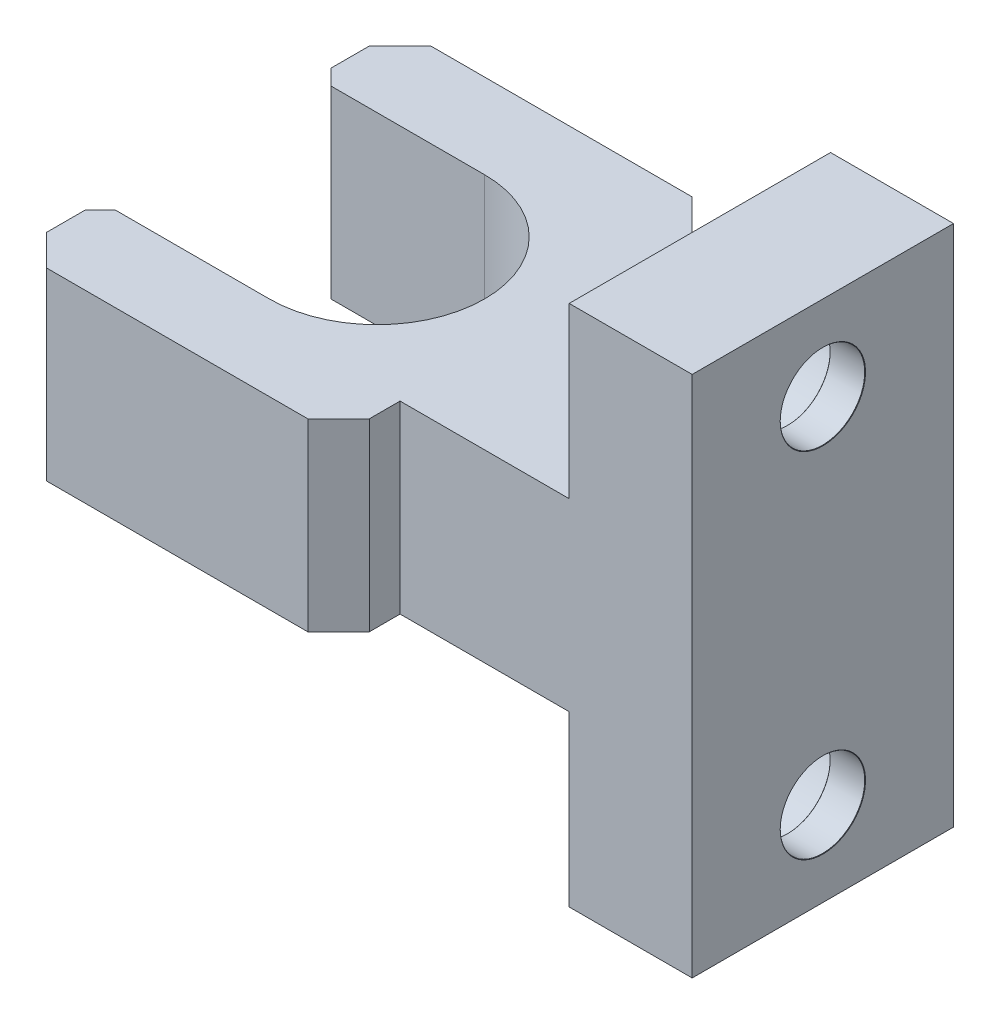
ISO-10303-21;
HEADER;
FILE_DESCRIPTION(('STEP AP214'),'2;1');
FILE_NAME('part.step','',(''),(''),'','','');
FILE_SCHEMA(('AUTOMOTIVE_DESIGN { 1 0 10303 214 1 1 1 1 }'));
ENDSEC;
DATA;
#1=APPLICATION_CONTEXT('core data for automotive mechanical design processes');
#2=APPLICATION_PROTOCOL_DEFINITION('international standard','automotive_design',2000,#1);
#3=PRODUCT_CONTEXT('',#1,'mechanical');
#4=PRODUCT('Part','Part','',(#3));
#5=PRODUCT_RELATED_PRODUCT_CATEGORY('part','',(#4));
#6=PRODUCT_DEFINITION_FORMATION('','',#4);
#7=PRODUCT_DEFINITION_CONTEXT('part definition',#1,'design');
#8=PRODUCT_DEFINITION('design','',#6,#7);
#9=PRODUCT_DEFINITION_SHAPE('','',#8);
#10=(LENGTH_UNIT() NAMED_UNIT(*) SI_UNIT(.MILLI.,.METRE.));
#11=(NAMED_UNIT(*) PLANE_ANGLE_UNIT() SI_UNIT($,.RADIAN.));
#12=(NAMED_UNIT(*) SI_UNIT($,.STERADIAN.) SOLID_ANGLE_UNIT());
#13=UNCERTAINTY_MEASURE_WITH_UNIT(LENGTH_MEASURE(1.E-05),#10,'distance_accuracy_value','');
#14=(GEOMETRIC_REPRESENTATION_CONTEXT(3) GLOBAL_UNCERTAINTY_ASSIGNED_CONTEXT((#13)) GLOBAL_UNIT_ASSIGNED_CONTEXT((#10,
#11,#12)) REPRESENTATION_CONTEXT('',''));
#15=CARTESIAN_POINT('',(0.,0.,0.));
#16=DIRECTION('',(0.,0.,1.));
#17=DIRECTION('',(1.,0.,0.));
#18=AXIS2_PLACEMENT_3D('',#15,#16,#17);
#19=CARTESIAN_POINT('',(-100.,-256.106230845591,17.));
#20=DIRECTION('',(1.,0.,0.));
#21=DIRECTION('',(0.,0.,-1.));
#22=AXIS2_PLACEMENT_3D('',#19,#20,#21);
#23=PLANE('',#22);
#24=DIRECTION('',(0.,0.,-1.));
#25=VECTOR('',#24,1.);
#26=CARTESIAN_POINT('',(-100.,-244.106230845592,17.));
#27=LINE('',#26,#25);
#28=CARTESIAN_POINT('',(-100.,-244.106230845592,19.));
#29=VERTEX_POINT('',#28);
#30=CARTESIAN_POINT('',(-100.,-244.106230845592,16.5));
#31=VERTEX_POINT('',#30);
#32=EDGE_CURVE('E292',#29,#31,#27,.T.);
#33=ORIENTED_EDGE('',*,*,#32,.T.);
#34=DIRECTION('',(0.,-1.,0.));
#35=VECTOR('',#34,1.);
#36=CARTESIAN_POINT('',(-100.,-256.106230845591,16.5));
#37=LINE('',#36,#35);
#38=CARTESIAN_POINT('',(-100.,-256.106230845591,16.5));
#39=VERTEX_POINT('',#38);
#40=EDGE_CURVE('E24',#31,#39,#37,.T.);
#41=ORIENTED_EDGE('',*,*,#40,.T.);
#42=DIRECTION('',(0.,0.,-1.));
#43=VECTOR('',#42,1.);
#44=CARTESIAN_POINT('',(-100.,-256.106230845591,17.));
#45=LINE('',#44,#43);
#46=CARTESIAN_POINT('',(-100.,-256.106230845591,19.));
#47=VERTEX_POINT('',#46);
#48=EDGE_CURVE('E290',#47,#39,#45,.T.);
#49=ORIENTED_EDGE('',*,*,#48,.F.);
#50=DIRECTION('',(0.,1.,0.));
#51=VECTOR('',#50,1.);
#52=CARTESIAN_POINT('',(-100.,-244.106230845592,19.));
#53=LINE('',#52,#51);
#54=EDGE_CURVE('E271',#47,#29,#53,.T.);
#55=ORIENTED_EDGE('',*,*,#54,.T.);
#56=EDGE_LOOP('',(#33,#41,#49,#55));
#57=FACE_BOUND('',#56,.T.);
#58=ADVANCED_FACE('F16',(#57),#23,.F.);
#59=CARTESIAN_POINT('',(0.,0.,17.));
#60=DIRECTION('',(0.,0.,1.));
#61=DIRECTION('',(1.,0.,0.));
#62=AXIS2_PLACEMENT_3D('',#59,#60,#61);
#63=PLANE('',#62);
#64=DIRECTION('',(-1.,0.,0.));
#65=VECTOR('',#64,1.);
#66=CARTESIAN_POINT('',(-68.,-244.106230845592,17.));
#67=LINE('',#66,#65);
#68=CARTESIAN_POINT('',(-68.,-244.106230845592,17.));
#69=VERTEX_POINT('',#68);
#70=CARTESIAN_POINT('',(-79.,-244.106230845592,17.));
#71=VERTEX_POINT('',#70);
#72=EDGE_CURVE('E243',#69,#71,#67,.T.);
#73=ORIENTED_EDGE('',*,*,#72,.T.);
#74=DIRECTION('',(0.,-1.,0.));
#75=VECTOR('',#74,1.);
#76=CARTESIAN_POINT('',(-79.,-244.106230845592,17.));
#77=LINE('',#76,#75);
#78=CARTESIAN_POINT('',(-79.,-256.106230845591,17.));
#79=VERTEX_POINT('',#78);
#80=EDGE_CURVE('E204',#71,#79,#77,.T.);
#81=ORIENTED_EDGE('',*,*,#80,.T.);
#82=DIRECTION('',(1.,0.,0.));
#83=VECTOR('',#82,1.);
#84=CARTESIAN_POINT('',(-68.,-256.106230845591,17.));
#85=LINE('',#84,#83);
#86=CARTESIAN_POINT('',(-68.,-256.106230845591,17.));
#87=VERTEX_POINT('',#86);
#88=EDGE_CURVE('E368',#79,#87,#85,.T.);
#89=ORIENTED_EDGE('',*,*,#88,.T.);
#90=DIRECTION('',(0.,-1.,0.));
#91=VECTOR('',#90,1.);
#92=CARTESIAN_POINT('',(-68.,-267.106230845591,17.));
#93=LINE('',#92,#91);
#94=CARTESIAN_POINT('',(-68.,-267.106230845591,17.));
#95=VERTEX_POINT('',#94);
#96=EDGE_CURVE('E339',#87,#95,#93,.T.);
#97=ORIENTED_EDGE('',*,*,#96,.T.);
#98=DIRECTION('',(1.,0.,0.));
#99=VECTOR('',#98,1.);
#100=CARTESIAN_POINT('',(-60.,-267.106230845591,17.));
#101=LINE('',#100,#99);
#102=CARTESIAN_POINT('',(-60.,-267.106230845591,17.));
#103=VERTEX_POINT('',#102);
#104=EDGE_CURVE('E327',#95,#103,#101,.T.);
#105=ORIENTED_EDGE('',*,*,#104,.T.);
#106=DIRECTION('',(0.,1.,0.));
#107=VECTOR('',#106,1.);
#108=CARTESIAN_POINT('',(-60.,-267.106230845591,17.));
#109=LINE('',#108,#107);
#110=CARTESIAN_POINT('',(-60.,-233.106230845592,17.));
#111=VERTEX_POINT('',#110);
#112=EDGE_CURVE('E323',#103,#111,#109,.T.);
#113=ORIENTED_EDGE('',*,*,#112,.T.);
#114=DIRECTION('',(-1.,0.,0.));
#115=VECTOR('',#114,1.);
#116=CARTESIAN_POINT('',(-60.,-233.106230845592,17.));
#117=LINE('',#116,#115);
#118=CARTESIAN_POINT('',(-68.,-233.106230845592,17.));
#119=VERTEX_POINT('',#118);
#120=EDGE_CURVE('E357',#111,#119,#117,.T.);
#121=ORIENTED_EDGE('',*,*,#120,.T.);
#122=DIRECTION('',(0.,-1.,0.));
#123=VECTOR('',#122,1.);
#124=CARTESIAN_POINT('',(-68.,-244.106230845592,17.));
#125=LINE('',#124,#123);
#126=EDGE_CURVE('E359',#119,#69,#125,.T.);
#127=ORIENTED_EDGE('',*,*,#126,.T.);
#128=EDGE_LOOP('',(#73,#81,#89,#97,#105,#113,#121,#127));
#129=FACE_BOUND('',#128,.T.);
#130=ADVANCED_FACE('F376',(#129),#63,.T.);
#131=CARTESIAN_POINT('',(0.,0.,0.));
#132=DIRECTION('',(0.,0.,1.));
#133=DIRECTION('',(1.,0.,0.));
#134=AXIS2_PLACEMENT_3D('',#131,#132,#133);
#135=PLANE('',#134);
#136=DIRECTION('',(0.,-1.,0.));
#137=VECTOR('',#136,1.);
#138=CARTESIAN_POINT('',(-79.,-244.106230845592,0.));
#139=LINE('',#138,#137);
#140=CARTESIAN_POINT('',(-79.,-244.106230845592,0.));
#141=VERTEX_POINT('',#140);
#142=CARTESIAN_POINT('',(-79.,-256.106230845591,0.));
#143=VERTEX_POINT('',#142);
#144=EDGE_CURVE('E238',#141,#143,#139,.T.);
#145=ORIENTED_EDGE('',*,*,#144,.F.);
#146=DIRECTION('',(-1.,0.,0.));
#147=VECTOR('',#146,1.);
#148=CARTESIAN_POINT('',(-68.,-244.106230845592,0.));
#149=LINE('',#148,#147);
#150=CARTESIAN_POINT('',(-68.,-244.106230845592,0.));
#151=VERTEX_POINT('',#150);
#152=EDGE_CURVE('E314',#151,#141,#149,.T.);
#153=ORIENTED_EDGE('',*,*,#152,.F.);
#154=DIRECTION('',(0.,-1.,0.));
#155=VECTOR('',#154,1.);
#156=CARTESIAN_POINT('',(-68.,-244.106230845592,0.));
#157=LINE('',#156,#155);
#158=CARTESIAN_POINT('',(-68.,-233.106230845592,0.));
#159=VERTEX_POINT('',#158);
#160=EDGE_CURVE('E532',#159,#151,#157,.T.);
#161=ORIENTED_EDGE('',*,*,#160,.F.);
#162=DIRECTION('',(-1.,0.,0.));
#163=VECTOR('',#162,1.);
#164=CARTESIAN_POINT('',(-60.,-233.106230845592,0.));
#165=LINE('',#164,#163);
#166=CARTESIAN_POINT('',(-60.,-233.106230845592,0.));
#167=VERTEX_POINT('',#166);
#168=EDGE_CURVE('E534',#167,#159,#165,.T.);
#169=ORIENTED_EDGE('',*,*,#168,.F.);
#170=DIRECTION('',(0.,1.,0.));
#171=VECTOR('',#170,1.);
#172=CARTESIAN_POINT('',(-60.,-267.106230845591,0.));
#173=LINE('',#172,#171);
#174=CARTESIAN_POINT('',(-60.,-267.106230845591,0.));
#175=VERTEX_POINT('',#174);
#176=EDGE_CURVE('E348',#175,#167,#173,.T.);
#177=ORIENTED_EDGE('',*,*,#176,.F.);
#178=DIRECTION('',(1.,0.,0.));
#179=VECTOR('',#178,1.);
#180=CARTESIAN_POINT('',(-60.,-267.106230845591,0.));
#181=LINE('',#180,#179);
#182=CARTESIAN_POINT('',(-68.,-267.106230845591,0.));
#183=VERTEX_POINT('',#182);
#184=EDGE_CURVE('E321',#183,#175,#181,.T.);
#185=ORIENTED_EDGE('',*,*,#184,.F.);
#186=DIRECTION('',(0.,-1.,0.));
#187=VECTOR('',#186,1.);
#188=CARTESIAN_POINT('',(-68.,-267.106230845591,0.));
#189=LINE('',#188,#187);
#190=CARTESIAN_POINT('',(-68.,-256.106230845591,0.));
#191=VERTEX_POINT('',#190);
#192=EDGE_CURVE('E313',#191,#183,#189,.T.);
#193=ORIENTED_EDGE('',*,*,#192,.F.);
#194=DIRECTION('',(1.,0.,0.));
#195=VECTOR('',#194,1.);
#196=CARTESIAN_POINT('',(-68.,-256.106230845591,0.));
#197=LINE('',#196,#195);
#198=EDGE_CURVE('E311',#143,#191,#197,.T.);
#199=ORIENTED_EDGE('',*,*,#198,.F.);
#200=EDGE_LOOP('',(#145,#153,#161,#169,#177,#185,#193,#199));
#201=FACE_BOUND('',#200,.T.);
#202=ADVANCED_FACE('F344',(#201),#135,.F.);
#203=CARTESIAN_POINT('',(-60.,-267.106230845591,17.));
#204=DIRECTION('',(-1.,0.,0.));
#205=DIRECTION('',(0.,-1.,0.));
#206=AXIS2_PLACEMENT_3D('',#203,#204,#205);
#207=PLANE('',#206);
#208=CARTESIAN_POINT('',(-60.,-261.606230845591,8.5));
#209=DIRECTION('',(-1.,0.,0.));
#210=DIRECTION('',(0.,0.,1.));
#211=AXIS2_PLACEMENT_3D('',#208,#209,#210);
#212=CIRCLE('',#211,2.775);
#213=CARTESIAN_POINT('',(-60.,-261.606230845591,11.275));
#214=VERTEX_POINT('',#213);
#215=EDGE_CURVE('E455',#214,#214,#212,.T.);
#216=ORIENTED_EDGE('',*,*,#215,.T.);
#217=EDGE_LOOP('',(#216));
#218=FACE_BOUND('',#217,.T.);
#219=CARTESIAN_POINT('',(-60.,-238.606230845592,8.5));
#220=DIRECTION('',(-1.,0.,0.));
#221=DIRECTION('',(0.,0.,1.));
#222=AXIS2_PLACEMENT_3D('',#219,#220,#221);
#223=CIRCLE('',#222,2.775);
#224=CARTESIAN_POINT('',(-60.,-238.606230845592,11.275));
#225=VERTEX_POINT('',#224);
#226=EDGE_CURVE('E474',#225,#225,#223,.T.);
#227=ORIENTED_EDGE('',*,*,#226,.T.);
#228=EDGE_LOOP('',(#227));
#229=FACE_BOUND('',#228,.T.);
#230=ORIENTED_EDGE('',*,*,#176,.T.);
#231=DIRECTION('',(0.,0.,-1.));
#232=VECTOR('',#231,1.);
#233=CARTESIAN_POINT('',(-60.,-233.106230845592,17.));
#234=LINE('',#233,#232);
#235=EDGE_CURVE('E227',#111,#167,#234,.T.);
#236=ORIENTED_EDGE('',*,*,#235,.F.);
#237=ORIENTED_EDGE('',*,*,#112,.F.);
#238=DIRECTION('',(0.,0.,-1.));
#239=VECTOR('',#238,1.);
#240=CARTESIAN_POINT('',(-60.,-267.106230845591,17.));
#241=LINE('',#240,#239);
#242=EDGE_CURVE('E324',#103,#175,#241,.T.);
#243=ORIENTED_EDGE('',*,*,#242,.T.);
#244=EDGE_LOOP('',(#230,#236,#237,#243));
#245=FACE_BOUND('',#244,.T.);
#246=ADVANCED_FACE('F353',(#218,#229,#245),#207,.F.);
#247=CARTESIAN_POINT('',(-60.,-233.106230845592,17.));
#248=DIRECTION('',(0.,-1.,0.));
#249=DIRECTION('',(0.,0.,-1.));
#250=AXIS2_PLACEMENT_3D('',#247,#248,#249);
#251=PLANE('',#250);
#252=ORIENTED_EDGE('',*,*,#168,.T.);
#253=DIRECTION('',(0.,0.,-1.));
#254=VECTOR('',#253,1.);
#255=CARTESIAN_POINT('',(-68.,-233.106230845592,17.));
#256=LINE('',#255,#254);
#257=EDGE_CURVE('E306',#119,#159,#256,.T.);
#258=ORIENTED_EDGE('',*,*,#257,.F.);
#259=ORIENTED_EDGE('',*,*,#120,.F.);
#260=ORIENTED_EDGE('',*,*,#235,.T.);
#261=EDGE_LOOP('',(#252,#258,#259,#260));
#262=FACE_BOUND('',#261,.T.);
#263=ADVANCED_FACE('F529',(#262),#251,.F.);
#264=CARTESIAN_POINT('',(-68.,-244.106230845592,17.));
#265=DIRECTION('',(1.,0.,0.));
#266=DIRECTION('',(0.,0.,-1.));
#267=AXIS2_PLACEMENT_3D('',#264,#265,#266);
#268=PLANE('',#267);
#269=CARTESIAN_POINT('',(-68.,-238.606230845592,8.5));
#270=DIRECTION('',(-1.,0.,0.));
#271=DIRECTION('',(0.,0.,1.));
#272=AXIS2_PLACEMENT_3D('',#269,#270,#271);
#273=CIRCLE('',#272,5.025);
#274=CARTESIAN_POINT('',(-68.,-238.606230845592,13.525));
#275=VERTEX_POINT('',#274);
#276=EDGE_CURVE('E477',#275,#275,#273,.T.);
#277=ORIENTED_EDGE('',*,*,#276,.F.);
#278=EDGE_LOOP('',(#277));
#279=FACE_BOUND('',#278,.T.);
#280=ORIENTED_EDGE('',*,*,#160,.T.);
#281=DIRECTION('',(0.,0.,-1.));
#282=VECTOR('',#281,1.);
#283=CARTESIAN_POINT('',(-68.,-244.106230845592,17.));
#284=LINE('',#283,#282);
#285=EDGE_CURVE('E303',#69,#151,#284,.T.);
#286=ORIENTED_EDGE('',*,*,#285,.F.);
#287=ORIENTED_EDGE('',*,*,#126,.F.);
#288=ORIENTED_EDGE('',*,*,#257,.T.);
#289=EDGE_LOOP('',(#280,#286,#287,#288));
#290=FACE_BOUND('',#289,.T.);
#291=ADVANCED_FACE('F427',(#279,#290),#268,.F.);
#292=CARTESIAN_POINT('',(-68.,-244.106230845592,17.));
#293=DIRECTION('',(0.,-1.,0.));
#294=DIRECTION('',(0.,0.,-1.));
#295=AXIS2_PLACEMENT_3D('',#292,#293,#294);
#296=PLANE('',#295);
#297=CARTESIAN_POINT('',(-100.,-244.106230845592,0.5));
#298=VERTEX_POINT('',#297);
#299=CARTESIAN_POINT('',(-100.,-244.106230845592,-2.));
#300=VERTEX_POINT('',#299);
#301=EDGE_CURVE('E295',#298,#300,#27,.T.);
#302=ORIENTED_EDGE('',*,*,#301,.F.);
#303=DIRECTION('',(-0.707106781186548,0.,-0.707106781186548));
#304=VECTOR('',#303,1.);
#305=CARTESIAN_POINT('',(-99.,-244.106230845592,1.5));
#306=LINE('',#305,#304);
#307=CARTESIAN_POINT('',(-99.,-244.106230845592,1.5));
#308=VERTEX_POINT('',#307);
#309=EDGE_CURVE('E284',#298,#308,#306,.F.);
#310=ORIENTED_EDGE('',*,*,#309,.T.);
#311=DIRECTION('',(1.,0.,0.));
#312=VECTOR('',#311,1.);
#313=CARTESIAN_POINT('',(-68.,-244.106230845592,1.5));
#314=LINE('',#313,#312);
#315=CARTESIAN_POINT('',(-89.,-244.106230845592,1.5));
#316=VERTEX_POINT('',#315);
#317=EDGE_CURVE('E194',#308,#316,#314,.T.);
#318=ORIENTED_EDGE('',*,*,#317,.T.);
#319=CARTESIAN_POINT('',(-89.,-244.106230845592,8.5));
#320=DIRECTION('',(0.,-1.,0.));
#321=DIRECTION('',(0.,0.,-1.));
#322=AXIS2_PLACEMENT_3D('',#319,#320,#321);
#323=CIRCLE('',#322,7.);
#324=CARTESIAN_POINT('',(-89.,-244.106230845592,15.5));
#325=VERTEX_POINT('',#324);
#326=EDGE_CURVE('E185',#316,#325,#323,.T.);
#327=ORIENTED_EDGE('',*,*,#326,.T.);
#328=DIRECTION('',(-1.,0.,0.));
#329=VECTOR('',#328,1.);
#330=CARTESIAN_POINT('',(-68.,-244.106230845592,15.5));
#331=LINE('',#330,#329);
#332=CARTESIAN_POINT('',(-99.,-244.106230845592,15.5));
#333=VERTEX_POINT('',#332);
#334=EDGE_CURVE('E198',#325,#333,#331,.T.);
#335=ORIENTED_EDGE('',*,*,#334,.T.);
#336=DIRECTION('',(0.707106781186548,0.,-0.707106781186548));
#337=VECTOR('',#336,1.);
#338=CARTESIAN_POINT('',(-100.,-244.106230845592,16.5));
#339=LINE('',#338,#337);
#340=EDGE_CURVE('E31',#333,#31,#339,.F.);
#341=ORIENTED_EDGE('',*,*,#340,.T.);
#342=ORIENTED_EDGE('',*,*,#32,.F.);
#343=DIRECTION('',(0.707106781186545,0.,0.70710678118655));
#344=VECTOR('',#343,1.);
#345=CARTESIAN_POINT('',(-98.,-244.106230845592,21.));
#346=LINE('',#345,#344);
#347=CARTESIAN_POINT('',(-98.,-244.106230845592,21.));
#348=VERTEX_POINT('',#347);
#349=EDGE_CURVE('E256',#29,#348,#346,.T.);
#350=ORIENTED_EDGE('',*,*,#349,.T.);
#351=DIRECTION('',(-1.,0.,0.));
#352=VECTOR('',#351,1.);
#353=CARTESIAN_POINT('',(-100.,-244.106230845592,21.));
#354=LINE('',#353,#352);
#355=CARTESIAN_POINT('',(-81.,-244.106230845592,21.));
#356=VERTEX_POINT('',#355);
#357=EDGE_CURVE('E201',#356,#348,#354,.T.);
#358=ORIENTED_EDGE('',*,*,#357,.F.);
#359=DIRECTION('',(-0.70710678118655,0.,0.707106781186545));
#360=VECTOR('',#359,1.);
#361=CARTESIAN_POINT('',(-79.,-244.106230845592,19.));
#362=LINE('',#361,#360);
#363=CARTESIAN_POINT('',(-79.,-244.106230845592,19.));
#364=VERTEX_POINT('',#363);
#365=EDGE_CURVE('E254',#356,#364,#362,.F.);
#366=ORIENTED_EDGE('',*,*,#365,.T.);
#367=DIRECTION('',(0.,0.,1.));
#368=VECTOR('',#367,1.);
#369=CARTESIAN_POINT('',(-79.,-244.106230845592,17.));
#370=LINE('',#369,#368);
#371=EDGE_CURVE('E205',#71,#364,#370,.T.);
#372=ORIENTED_EDGE('',*,*,#371,.F.);
#373=ORIENTED_EDGE('',*,*,#72,.F.);
#374=ORIENTED_EDGE('',*,*,#285,.T.);
#375=ORIENTED_EDGE('',*,*,#152,.T.);
#376=DIRECTION('',(0.,0.,1.));
#377=VECTOR('',#376,1.);
#378=CARTESIAN_POINT('',(-79.,-244.106230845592,0.));
#379=LINE('',#378,#377);
#380=CARTESIAN_POINT('',(-79.,-244.106230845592,-2.));
#381=VERTEX_POINT('',#380);
#382=EDGE_CURVE('E247',#381,#141,#379,.T.);
#383=ORIENTED_EDGE('',*,*,#382,.F.);
#384=DIRECTION('',(0.707106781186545,0.,0.70710678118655));
#385=VECTOR('',#384,1.);
#386=CARTESIAN_POINT('',(-81.,-244.106230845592,-4.));
#387=LINE('',#386,#385);
#388=CARTESIAN_POINT('',(-81.,-244.106230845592,-4.));
#389=VERTEX_POINT('',#388);
#390=EDGE_CURVE('E261',#381,#389,#387,.F.);
#391=ORIENTED_EDGE('',*,*,#390,.T.);
#392=DIRECTION('',(1.,0.,0.));
#393=VECTOR('',#392,1.);
#394=CARTESIAN_POINT('',(-100.,-244.106230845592,-4.));
#395=LINE('',#394,#393);
#396=CARTESIAN_POINT('',(-98.,-244.106230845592,-4.));
#397=VERTEX_POINT('',#396);
#398=EDGE_CURVE('E211',#397,#389,#395,.T.);
#399=ORIENTED_EDGE('',*,*,#398,.F.);
#400=DIRECTION('',(-0.70710678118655,0.,0.707106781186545));
#401=VECTOR('',#400,1.);
#402=CARTESIAN_POINT('',(-100.,-244.106230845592,-2.));
#403=LINE('',#402,#401);
#404=EDGE_CURVE('E258',#397,#300,#403,.T.);
#405=ORIENTED_EDGE('',*,*,#404,.T.);
#406=EDGE_LOOP('',(#302,#310,#318,#327,#335,#341,#342,#350,#358,#366,#372,#373,#374,#375,#383,
#391,#399,#405));
#407=FACE_BOUND('',#406,.T.);
#408=ADVANCED_FACE('F381',(#407),#296,.F.);
#409=CARTESIAN_POINT('',(-100.,-256.106230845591,0.5));
#410=VERTEX_POINT('',#409);
#411=CARTESIAN_POINT('',(-100.,-256.106230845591,-2.));
#412=VERTEX_POINT('',#411);
#413=EDGE_CURVE('E296',#410,#412,#45,.T.);
#414=ORIENTED_EDGE('',*,*,#413,.F.);
#415=DIRECTION('',(0.,1.,0.));
#416=VECTOR('',#415,1.);
#417=CARTESIAN_POINT('',(-100.,-256.106230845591,0.5));
#418=LINE('',#417,#416);
#419=EDGE_CURVE('E281',#410,#298,#418,.T.);
#420=ORIENTED_EDGE('',*,*,#419,.T.);
#421=ORIENTED_EDGE('',*,*,#301,.T.);
#422=DIRECTION('',(0.,-1.,0.));
#423=VECTOR('',#422,1.);
#424=CARTESIAN_POINT('',(-100.,-256.106230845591,-2.));
#425=LINE('',#424,#423);
#426=EDGE_CURVE('E263',#300,#412,#425,.T.);
#427=ORIENTED_EDGE('',*,*,#426,.T.);
#428=EDGE_LOOP('',(#414,#420,#421,#427));
#429=FACE_BOUND('',#428,.T.);
#430=ADVANCED_FACE('F417',(#429),#23,.F.);
#431=CARTESIAN_POINT('',(-68.,-256.106230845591,17.));
#432=DIRECTION('',(0.,1.,0.));
#433=DIRECTION('',(0.,0.,1.));
#434=AXIS2_PLACEMENT_3D('',#431,#432,#433);
#435=PLANE('',#434);
#436=DIRECTION('',(1.,0.,0.));
#437=VECTOR('',#436,1.);
#438=CARTESIAN_POINT('',(-100.,-256.106230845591,1.5));
#439=LINE('',#438,#437);
#440=CARTESIAN_POINT('',(-99.,-256.106230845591,1.5));
#441=VERTEX_POINT('',#440);
#442=CARTESIAN_POINT('',(-89.,-256.106230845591,1.5));
#443=VERTEX_POINT('',#442);
#444=EDGE_CURVE('E166',#441,#443,#439,.T.);
#445=ORIENTED_EDGE('',*,*,#444,.F.);
#446=DIRECTION('',(0.707106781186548,0.,0.707106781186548));
#447=VECTOR('',#446,1.);
#448=CARTESIAN_POINT('',(-99.,-256.106230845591,1.5));
#449=LINE('',#448,#447);
#450=EDGE_CURVE('E279',#441,#410,#449,.F.);
#451=ORIENTED_EDGE('',*,*,#450,.T.);
#452=ORIENTED_EDGE('',*,*,#413,.T.);
#453=DIRECTION('',(0.70710678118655,0.,-0.707106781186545));
#454=VECTOR('',#453,1.);
#455=CARTESIAN_POINT('',(-100.,-256.106230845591,-2.));
#456=LINE('',#455,#454);
#457=CARTESIAN_POINT('',(-98.,-256.106230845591,-4.));
#458=VERTEX_POINT('',#457);
#459=EDGE_CURVE('E389',#412,#458,#456,.T.);
#460=ORIENTED_EDGE('',*,*,#459,.T.);
#461=DIRECTION('',(1.,0.,0.));
#462=VECTOR('',#461,1.);
#463=CARTESIAN_POINT('',(-100.,-256.106230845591,-4.));
#464=LINE('',#463,#462);
#465=CARTESIAN_POINT('',(-81.,-256.106230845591,-4.));
#466=VERTEX_POINT('',#465);
#467=EDGE_CURVE('E217',#458,#466,#464,.T.);
#468=ORIENTED_EDGE('',*,*,#467,.T.);
#469=DIRECTION('',(-0.707106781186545,0.,-0.70710678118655));
#470=VECTOR('',#469,1.);
#471=CARTESIAN_POINT('',(-81.,-256.106230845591,-4.));
#472=LINE('',#471,#470);
#473=CARTESIAN_POINT('',(-79.,-256.106230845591,-2.));
#474=VERTEX_POINT('',#473);
#475=EDGE_CURVE('E250',#466,#474,#472,.F.);
#476=ORIENTED_EDGE('',*,*,#475,.T.);
#477=DIRECTION('',(0.,0.,1.));
#478=VECTOR('',#477,1.);
#479=CARTESIAN_POINT('',(-79.,-256.106230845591,0.));
#480=LINE('',#479,#478);
#481=EDGE_CURVE('E231',#474,#143,#480,.T.);
#482=ORIENTED_EDGE('',*,*,#481,.T.);
#483=ORIENTED_EDGE('',*,*,#198,.T.);
#484=DIRECTION('',(0.,0.,-1.));
#485=VECTOR('',#484,1.);
#486=CARTESIAN_POINT('',(-68.,-256.106230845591,17.));
#487=LINE('',#486,#485);
#488=EDGE_CURVE('E299',#87,#191,#487,.T.);
#489=ORIENTED_EDGE('',*,*,#488,.F.);
#490=ORIENTED_EDGE('',*,*,#88,.F.);
#491=DIRECTION('',(0.,0.,1.));
#492=VECTOR('',#491,1.);
#493=CARTESIAN_POINT('',(-79.,-256.106230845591,17.));
#494=LINE('',#493,#492);
#495=CARTESIAN_POINT('',(-79.,-256.106230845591,19.));
#496=VERTEX_POINT('',#495);
#497=EDGE_CURVE('E200',#79,#496,#494,.T.);
#498=ORIENTED_EDGE('',*,*,#497,.T.);
#499=DIRECTION('',(0.70710678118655,0.,-0.707106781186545));
#500=VECTOR('',#499,1.);
#501=CARTESIAN_POINT('',(-79.,-256.106230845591,19.));
#502=LINE('',#501,#500);
#503=CARTESIAN_POINT('',(-81.,-256.106230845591,21.));
#504=VERTEX_POINT('',#503);
#505=EDGE_CURVE('E230',#496,#504,#502,.F.);
#506=ORIENTED_EDGE('',*,*,#505,.T.);
#507=DIRECTION('',(-1.,0.,0.));
#508=VECTOR('',#507,1.);
#509=CARTESIAN_POINT('',(-100.,-256.106230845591,21.));
#510=LINE('',#509,#508);
#511=CARTESIAN_POINT('',(-98.,-256.106230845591,21.));
#512=VERTEX_POINT('',#511);
#513=EDGE_CURVE('E206',#504,#512,#510,.T.);
#514=ORIENTED_EDGE('',*,*,#513,.T.);
#515=DIRECTION('',(-0.707106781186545,0.,-0.70710678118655));
#516=VECTOR('',#515,1.);
#517=CARTESIAN_POINT('',(-98.,-256.106230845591,21.));
#518=LINE('',#517,#516);
#519=EDGE_CURVE('E294',#512,#47,#518,.T.);
#520=ORIENTED_EDGE('',*,*,#519,.T.);
#521=ORIENTED_EDGE('',*,*,#48,.T.);
#522=DIRECTION('',(-0.707106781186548,0.,0.707106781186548));
#523=VECTOR('',#522,1.);
#524=CARTESIAN_POINT('',(-100.,-256.106230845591,16.5));
#525=LINE('',#524,#523);
#526=CARTESIAN_POINT('',(-99.,-256.106230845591,15.5));
#527=VERTEX_POINT('',#526);
#528=EDGE_CURVE('E277',#39,#527,#525,.F.);
#529=ORIENTED_EDGE('',*,*,#528,.T.);
#530=DIRECTION('',(-1.,0.,0.));
#531=VECTOR('',#530,1.);
#532=CARTESIAN_POINT('',(-100.,-256.106230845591,15.5));
#533=LINE('',#532,#531);
#534=CARTESIAN_POINT('',(-89.,-256.106230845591,15.5));
#535=VERTEX_POINT('',#534);
#536=EDGE_CURVE('E187',#535,#527,#533,.T.);
#537=ORIENTED_EDGE('',*,*,#536,.F.);
#538=CARTESIAN_POINT('',(-89.,-256.106230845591,8.5));
#539=DIRECTION('',(0.,-1.,0.));
#540=DIRECTION('',(0.,0.,-1.));
#541=AXIS2_PLACEMENT_3D('',#538,#539,#540);
#542=CIRCLE('',#541,7.);
#543=EDGE_CURVE('E175',#443,#535,#542,.T.);
#544=ORIENTED_EDGE('',*,*,#543,.F.);
#545=EDGE_LOOP('',(#445,#451,#452,#460,#468,#476,#482,#483,#489,#490,#498,#506,#514,#520,#521,
#529,#537,#544));
#546=FACE_BOUND('',#545,.T.);
#547=ADVANCED_FACE('F189',(#546),#435,.F.);
#548=CARTESIAN_POINT('',(-68.,-267.106230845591,17.));
#549=DIRECTION('',(1.,0.,0.));
#550=DIRECTION('',(0.,0.,-1.));
#551=AXIS2_PLACEMENT_3D('',#548,#549,#550);
#552=PLANE('',#551);
#553=CARTESIAN_POINT('',(-68.,-261.606230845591,8.5));
#554=DIRECTION('',(-1.,0.,0.));
#555=DIRECTION('',(0.,0.,1.));
#556=AXIS2_PLACEMENT_3D('',#553,#554,#555);
#557=CIRCLE('',#556,5.025);
#558=CARTESIAN_POINT('',(-68.,-261.606230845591,13.525));
#559=VERTEX_POINT('',#558);
#560=EDGE_CURVE('E452',#559,#559,#557,.T.);
#561=ORIENTED_EDGE('',*,*,#560,.F.);
#562=EDGE_LOOP('',(#561));
#563=FACE_BOUND('',#562,.T.);
#564=ORIENTED_EDGE('',*,*,#192,.T.);
#565=DIRECTION('',(0.,0.,-1.));
#566=VECTOR('',#565,1.);
#567=CARTESIAN_POINT('',(-68.,-267.106230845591,17.));
#568=LINE('',#567,#566);
#569=EDGE_CURVE('E326',#95,#183,#568,.T.);
#570=ORIENTED_EDGE('',*,*,#569,.F.);
#571=ORIENTED_EDGE('',*,*,#96,.F.);
#572=ORIENTED_EDGE('',*,*,#488,.T.);
#573=EDGE_LOOP('',(#564,#570,#571,#572));
#574=FACE_BOUND('',#573,.T.);
#575=ADVANCED_FACE('F338',(#563,#574),#552,.F.);
#576=CARTESIAN_POINT('',(-60.,-267.106230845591,17.));
#577=DIRECTION('',(0.,1.,0.));
#578=DIRECTION('',(0.,0.,1.));
#579=AXIS2_PLACEMENT_3D('',#576,#577,#578);
#580=PLANE('',#579);
#581=ORIENTED_EDGE('',*,*,#184,.T.);
#582=ORIENTED_EDGE('',*,*,#242,.F.);
#583=ORIENTED_EDGE('',*,*,#104,.F.);
#584=ORIENTED_EDGE('',*,*,#569,.T.);
#585=EDGE_LOOP('',(#581,#582,#583,#584));
#586=FACE_BOUND('',#585,.T.);
#587=ADVANCED_FACE('F350',(#586),#580,.F.);
#588=CARTESIAN_POINT('',(-79.,-244.106230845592,0.));
#589=DIRECTION('',(1.,0.,0.));
#590=DIRECTION('',(0.,0.,-1.));
#591=AXIS2_PLACEMENT_3D('',#588,#589,#590);
#592=PLANE('',#591);
#593=ORIENTED_EDGE('',*,*,#481,.F.);
#594=DIRECTION('',(0.,1.,0.));
#595=VECTOR('',#594,1.);
#596=CARTESIAN_POINT('',(-79.,-244.106230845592,-2.));
#597=LINE('',#596,#595);
#598=EDGE_CURVE('E252',#474,#381,#597,.T.);
#599=ORIENTED_EDGE('',*,*,#598,.T.);
#600=ORIENTED_EDGE('',*,*,#382,.T.);
#601=ORIENTED_EDGE('',*,*,#144,.T.);
#602=EDGE_LOOP('',(#593,#599,#600,#601));
#603=FACE_BOUND('',#602,.T.);
#604=ADVANCED_FACE('F398',(#603),#592,.T.);
#605=CARTESIAN_POINT('',(-100.,-244.106230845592,-4.));
#606=DIRECTION('',(0.,0.,-1.));
#607=DIRECTION('',(-1.,0.,0.));
#608=AXIS2_PLACEMENT_3D('',#605,#606,#607);
#609=PLANE('',#608);
#610=ORIENTED_EDGE('',*,*,#398,.T.);
#611=DIRECTION('',(0.,-1.,0.));
#612=VECTOR('',#611,1.);
#613=CARTESIAN_POINT('',(-81.,-244.106230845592,-4.));
#614=LINE('',#613,#612);
#615=EDGE_CURVE('E226',#389,#466,#614,.T.);
#616=ORIENTED_EDGE('',*,*,#615,.T.);
#617=ORIENTED_EDGE('',*,*,#467,.F.);
#618=DIRECTION('',(0.,1.,0.));
#619=VECTOR('',#618,1.);
#620=CARTESIAN_POINT('',(-98.,-244.106230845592,-4.));
#621=LINE('',#620,#619);
#622=EDGE_CURVE('E224',#458,#397,#621,.T.);
#623=ORIENTED_EDGE('',*,*,#622,.T.);
#624=EDGE_LOOP('',(#610,#616,#617,#623));
#625=FACE_BOUND('',#624,.T.);
#626=ADVANCED_FACE('F406',(#625),#609,.T.);
#627=CARTESIAN_POINT('',(-100.,-244.106230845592,21.));
#628=DIRECTION('',(0.,0.,1.));
#629=DIRECTION('',(1.,0.,0.));
#630=AXIS2_PLACEMENT_3D('',#627,#628,#629);
#631=PLANE('',#630);
#632=ORIENTED_EDGE('',*,*,#357,.T.);
#633=DIRECTION('',(0.,-1.,0.));
#634=VECTOR('',#633,1.);
#635=CARTESIAN_POINT('',(-98.,-256.106230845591,21.));
#636=LINE('',#635,#634);
#637=EDGE_CURVE('E268',#348,#512,#636,.T.);
#638=ORIENTED_EDGE('',*,*,#637,.T.);
#639=ORIENTED_EDGE('',*,*,#513,.F.);
#640=DIRECTION('',(0.,1.,0.));
#641=VECTOR('',#640,1.);
#642=CARTESIAN_POINT('',(-81.,-244.106230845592,21.));
#643=LINE('',#642,#641);
#644=EDGE_CURVE('E266',#504,#356,#643,.T.);
#645=ORIENTED_EDGE('',*,*,#644,.T.);
#646=EDGE_LOOP('',(#632,#638,#639,#645));
#647=FACE_BOUND('',#646,.T.);
#648=ADVANCED_FACE('F579',(#647),#631,.T.);
#649=CARTESIAN_POINT('',(-79.,-244.106230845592,17.));
#650=DIRECTION('',(1.,0.,0.));
#651=DIRECTION('',(0.,0.,-1.));
#652=AXIS2_PLACEMENT_3D('',#649,#650,#651);
#653=PLANE('',#652);
#654=ORIENTED_EDGE('',*,*,#371,.T.);
#655=DIRECTION('',(0.,-1.,0.));
#656=VECTOR('',#655,1.);
#657=CARTESIAN_POINT('',(-79.,-244.106230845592,19.));
#658=LINE('',#657,#656);
#659=EDGE_CURVE('E273',#364,#496,#658,.T.);
#660=ORIENTED_EDGE('',*,*,#659,.T.);
#661=ORIENTED_EDGE('',*,*,#497,.F.);
#662=ORIENTED_EDGE('',*,*,#80,.F.);
#663=EDGE_LOOP('',(#654,#660,#661,#662));
#664=FACE_BOUND('',#663,.T.);
#665=ADVANCED_FACE('F372',(#664),#653,.T.);
#666=CARTESIAN_POINT('',(-100.,-233.106230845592,15.5));
#667=DIRECTION('',(0.,0.,1.));
#668=DIRECTION('',(1.,0.,0.));
#669=AXIS2_PLACEMENT_3D('',#666,#667,#668);
#670=PLANE('',#669);
#671=ORIENTED_EDGE('',*,*,#536,.T.);
#672=DIRECTION('',(0.,1.,0.));
#673=VECTOR('',#672,1.);
#674=CARTESIAN_POINT('',(-99.,-233.106230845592,15.5));
#675=LINE('',#674,#673);
#676=EDGE_CURVE('E11',#527,#333,#675,.T.);
#677=ORIENTED_EDGE('',*,*,#676,.T.);
#678=ORIENTED_EDGE('',*,*,#334,.F.);
#679=DIRECTION('',(0.,-1.,0.));
#680=VECTOR('',#679,1.);
#681=CARTESIAN_POINT('',(-89.,-233.106230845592,15.5));
#682=LINE('',#681,#680);
#683=EDGE_CURVE('E186',#325,#535,#682,.T.);
#684=ORIENTED_EDGE('',*,*,#683,.T.);
#685=EDGE_LOOP('',(#671,#677,#678,#684));
#686=FACE_BOUND('',#685,.T.);
#687=ADVANCED_FACE('F572',(#686),#670,.F.);
#688=CARTESIAN_POINT('',(-89.,-233.106230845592,8.5));
#689=DIRECTION('',(0.,-1.,0.));
#690=DIRECTION('',(0.,0.,-1.));
#691=AXIS2_PLACEMENT_3D('',#688,#689,#690);
#692=CYLINDRICAL_SURFACE('',#691,7.);
#693=DIRECTION('',(0.,-1.,0.));
#694=VECTOR('',#693,1.);
#695=CARTESIAN_POINT('',(-89.,-233.106230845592,1.5));
#696=LINE('',#695,#694);
#697=EDGE_CURVE('E170',#316,#443,#696,.T.);
#698=ORIENTED_EDGE('',*,*,#697,.T.);
#699=ORIENTED_EDGE('',*,*,#543,.T.);
#700=ORIENTED_EDGE('',*,*,#683,.F.);
#701=ORIENTED_EDGE('',*,*,#326,.F.);
#702=EDGE_LOOP('',(#698,#699,#700,#701));
#703=FACE_BOUND('',#702,.T.);
#704=ADVANCED_FACE('F181',(#703),#692,.F.);
#705=CARTESIAN_POINT('',(-100.,-233.106230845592,1.5));
#706=DIRECTION('',(0.,0.,-1.));
#707=DIRECTION('',(-1.,0.,0.));
#708=AXIS2_PLACEMENT_3D('',#705,#706,#707);
#709=PLANE('',#708);
#710=ORIENTED_EDGE('',*,*,#317,.F.);
#711=DIRECTION('',(0.,-1.,0.));
#712=VECTOR('',#711,1.);
#713=CARTESIAN_POINT('',(-99.,-233.106230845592,1.5));
#714=LINE('',#713,#712);
#715=EDGE_CURVE('E172',#308,#441,#714,.T.);
#716=ORIENTED_EDGE('',*,*,#715,.T.);
#717=ORIENTED_EDGE('',*,*,#444,.T.);
#718=ORIENTED_EDGE('',*,*,#697,.F.);
#719=EDGE_LOOP('',(#710,#716,#717,#718));
#720=FACE_BOUND('',#719,.T.);
#721=ADVANCED_FACE('F169',(#720),#709,.F.);
#722=CARTESIAN_POINT('',(-81.,-244.106230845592,-4.));
#723=DIRECTION('',(-0.70710678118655,0.,0.707106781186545));
#724=DIRECTION('',(0.,-1.,0.));
#725=AXIS2_PLACEMENT_3D('',#722,#723,#724);
#726=PLANE('',#725);
#727=ORIENTED_EDGE('',*,*,#390,.F.);
#728=ORIENTED_EDGE('',*,*,#598,.F.);
#729=ORIENTED_EDGE('',*,*,#475,.F.);
#730=ORIENTED_EDGE('',*,*,#615,.F.);
#731=EDGE_LOOP('',(#727,#728,#729,#730));
#732=FACE_BOUND('',#731,.T.);
#733=ADVANCED_FACE('F401',(#732),#726,.F.);
#734=CARTESIAN_POINT('',(-100.,-256.106230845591,-2.));
#735=DIRECTION('',(-0.707106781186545,0.,-0.70710678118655));
#736=DIRECTION('',(0.,1.,0.));
#737=AXIS2_PLACEMENT_3D('',#734,#735,#736);
#738=PLANE('',#737);
#739=ORIENTED_EDGE('',*,*,#404,.F.);
#740=ORIENTED_EDGE('',*,*,#622,.F.);
#741=ORIENTED_EDGE('',*,*,#459,.F.);
#742=ORIENTED_EDGE('',*,*,#426,.F.);
#743=EDGE_LOOP('',(#739,#740,#741,#742));
#744=FACE_BOUND('',#743,.T.);
#745=ADVANCED_FACE('F409',(#744),#738,.T.);
#746=CARTESIAN_POINT('',(-98.,-244.106230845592,21.));
#747=DIRECTION('',(-0.70710678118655,0.,0.707106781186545));
#748=DIRECTION('',(0.,1.,0.));
#749=AXIS2_PLACEMENT_3D('',#746,#747,#748);
#750=PLANE('',#749);
#751=ORIENTED_EDGE('',*,*,#349,.F.);
#752=ORIENTED_EDGE('',*,*,#54,.F.);
#753=ORIENTED_EDGE('',*,*,#519,.F.);
#754=ORIENTED_EDGE('',*,*,#637,.F.);
#755=EDGE_LOOP('',(#751,#752,#753,#754));
#756=FACE_BOUND('',#755,.T.);
#757=ADVANCED_FACE('F551',(#756),#750,.T.);
#758=CARTESIAN_POINT('',(-79.,-244.106230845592,19.));
#759=DIRECTION('',(-0.707106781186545,0.,-0.70710678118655));
#760=DIRECTION('',(0.,-1.,0.));
#761=AXIS2_PLACEMENT_3D('',#758,#759,#760);
#762=PLANE('',#761);
#763=ORIENTED_EDGE('',*,*,#365,.F.);
#764=ORIENTED_EDGE('',*,*,#644,.F.);
#765=ORIENTED_EDGE('',*,*,#505,.F.);
#766=ORIENTED_EDGE('',*,*,#659,.F.);
#767=EDGE_LOOP('',(#763,#764,#765,#766));
#768=FACE_BOUND('',#767,.T.);
#769=ADVANCED_FACE('F387',(#768),#762,.F.);
#770=CARTESIAN_POINT('',(-99.,-233.106230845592,1.5));
#771=DIRECTION('',(0.707106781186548,0.,-0.707106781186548));
#772=DIRECTION('',(0.,-1.,0.));
#773=AXIS2_PLACEMENT_3D('',#770,#771,#772);
#774=PLANE('',#773);
#775=ORIENTED_EDGE('',*,*,#309,.F.);
#776=ORIENTED_EDGE('',*,*,#419,.F.);
#777=ORIENTED_EDGE('',*,*,#450,.F.);
#778=ORIENTED_EDGE('',*,*,#715,.F.);
#779=EDGE_LOOP('',(#775,#776,#777,#778));
#780=FACE_BOUND('',#779,.T.);
#781=ADVANCED_FACE('F415',(#780),#774,.F.);
#782=CARTESIAN_POINT('',(-100.,-256.106230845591,16.5));
#783=DIRECTION('',(0.707106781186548,0.,0.707106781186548));
#784=DIRECTION('',(0.,-1.,0.));
#785=AXIS2_PLACEMENT_3D('',#782,#783,#784);
#786=PLANE('',#785);
#787=ORIENTED_EDGE('',*,*,#340,.F.);
#788=ORIENTED_EDGE('',*,*,#676,.F.);
#789=ORIENTED_EDGE('',*,*,#528,.F.);
#790=ORIENTED_EDGE('',*,*,#40,.F.);
#791=EDGE_LOOP('',(#787,#788,#789,#790));
#792=FACE_BOUND('',#791,.T.);
#793=ADVANCED_FACE('F18',(#792),#786,.F.);
#794=CARTESIAN_POINT('',(-60.025,-238.606230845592,8.5));
#795=DIRECTION('',(1.,0.,0.));
#796=DIRECTION('',(0.,0.,-1.));
#797=AXIS2_PLACEMENT_3D('',#794,#795,#796);
#798=CONICAL_SURFACE('',#797,2.75,0.785398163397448);
#799=ORIENTED_EDGE('',*,*,#226,.F.);
#800=EDGE_LOOP('',(#799));
#801=FACE_BOUND('',#800,.T.);
#802=CARTESIAN_POINT('',(-60.025,-238.606230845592,8.5));
#803=DIRECTION('',(-1.,0.,0.));
#804=DIRECTION('',(0.,0.,1.));
#805=AXIS2_PLACEMENT_3D('',#802,#803,#804);
#806=CIRCLE('',#805,2.75);
#807=CARTESIAN_POINT('',(-60.025,-238.606230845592,11.25));
#808=VERTEX_POINT('',#807);
#809=EDGE_CURVE('E176',#808,#808,#806,.T.);
#810=ORIENTED_EDGE('',*,*,#809,.T.);
#811=EDGE_LOOP('',(#810));
#812=FACE_BOUND('',#811,.T.);
#813=ADVANCED_FACE('F494',(#801,#812),#798,.F.);
#814=CARTESIAN_POINT('',(-68.,-238.606230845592,8.5));
#815=DIRECTION('',(-1.,0.,0.));
#816=DIRECTION('',(0.,0.,1.));
#817=AXIS2_PLACEMENT_3D('',#814,#815,#816);
#818=CYLINDRICAL_SURFACE('',#817,2.75);
#819=ORIENTED_EDGE('',*,*,#809,.F.);
#820=EDGE_LOOP('',(#819));
#821=FACE_BOUND('',#820,.T.);
#822=CARTESIAN_POINT('',(-62.275,-238.606230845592,8.5));
#823=DIRECTION('',(-1.,0.,0.));
#824=DIRECTION('',(0.,0.,1.));
#825=AXIS2_PLACEMENT_3D('',#822,#823,#824);
#826=CIRCLE('',#825,2.75);
#827=CARTESIAN_POINT('',(-62.275,-238.606230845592,11.25));
#828=VERTEX_POINT('',#827);
#829=EDGE_CURVE('E489',#828,#828,#826,.T.);
#830=ORIENTED_EDGE('',*,*,#829,.T.);
#831=EDGE_LOOP('',(#830));
#832=FACE_BOUND('',#831,.T.);
#833=ADVANCED_FACE('F496',(#821,#832),#818,.F.);
#834=CARTESIAN_POINT('',(-62.3,-238.606230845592,8.5));
#835=DIRECTION('',(-1.,0.,0.));
#836=DIRECTION('',(0.,0.,1.));
#837=AXIS2_PLACEMENT_3D('',#834,#835,#836);
#838=CONICAL_SURFACE('',#837,2.775,0.785398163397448);
#839=ORIENTED_EDGE('',*,*,#829,.F.);
#840=EDGE_LOOP('',(#839));
#841=FACE_BOUND('',#840,.T.);
#842=CARTESIAN_POINT('',(-62.3,-238.606230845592,8.5));
#843=DIRECTION('',(-1.,0.,0.));
#844=DIRECTION('',(0.,0.,1.));
#845=AXIS2_PLACEMENT_3D('',#842,#843,#844);
#846=CIRCLE('',#845,2.775);
#847=CARTESIAN_POINT('',(-62.3,-238.606230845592,11.275));
#848=VERTEX_POINT('',#847);
#849=EDGE_CURVE('E486',#848,#848,#846,.T.);
#850=ORIENTED_EDGE('',*,*,#849,.T.);
#851=EDGE_LOOP('',(#850));
#852=FACE_BOUND('',#851,.T.);
#853=ADVANCED_FACE('F499',(#841,#852),#838,.F.);
#854=CARTESIAN_POINT('',(-62.3,-235.831230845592,8.5));
#855=DIRECTION('',(1.,0.,0.));
#856=DIRECTION('',(0.,0.,-1.));
#857=AXIS2_PLACEMENT_3D('',#854,#855,#856);
#858=PLANE('',#857);
#859=ORIENTED_EDGE('',*,*,#849,.F.);
#860=EDGE_LOOP('',(#859));
#861=FACE_BOUND('',#860,.T.);
#862=CARTESIAN_POINT('',(-62.3,-238.606230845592,8.5));
#863=DIRECTION('',(-1.,0.,0.));
#864=DIRECTION('',(0.,0.,1.));
#865=AXIS2_PLACEMENT_3D('',#862,#863,#864);
#866=CIRCLE('',#865,5.);
#867=CARTESIAN_POINT('',(-62.3,-238.606230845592,13.5));
#868=VERTEX_POINT('',#867);
#869=EDGE_CURVE('E483',#868,#868,#866,.T.);
#870=ORIENTED_EDGE('',*,*,#869,.T.);
#871=EDGE_LOOP('',(#870));
#872=FACE_BOUND('',#871,.T.);
#873=ADVANCED_FACE('F505',(#861,#872),#858,.F.);
#874=CARTESIAN_POINT('',(-68.,-238.606230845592,8.5));
#875=DIRECTION('',(-1.,0.,0.));
#876=DIRECTION('',(0.,0.,1.));
#877=AXIS2_PLACEMENT_3D('',#874,#875,#876);
#878=CYLINDRICAL_SURFACE('',#877,5.);
#879=ORIENTED_EDGE('',*,*,#869,.F.);
#880=EDGE_LOOP('',(#879));
#881=FACE_BOUND('',#880,.T.);
#882=CARTESIAN_POINT('',(-67.975,-238.606230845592,8.5));
#883=DIRECTION('',(-1.,0.,0.));
#884=DIRECTION('',(0.,0.,1.));
#885=AXIS2_PLACEMENT_3D('',#882,#883,#884);
#886=CIRCLE('',#885,5.);
#887=CARTESIAN_POINT('',(-67.975,-238.606230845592,13.5));
#888=VERTEX_POINT('',#887);
#889=EDGE_CURVE('E480',#888,#888,#886,.T.);
#890=ORIENTED_EDGE('',*,*,#889,.T.);
#891=EDGE_LOOP('',(#890));
#892=FACE_BOUND('',#891,.T.);
#893=ADVANCED_FACE('F511',(#881,#892),#878,.F.);
#894=CARTESIAN_POINT('',(-68.,-238.606230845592,8.5));
#895=DIRECTION('',(-1.,0.,0.));
#896=DIRECTION('',(0.,0.,1.));
#897=AXIS2_PLACEMENT_3D('',#894,#895,#896);
#898=CONICAL_SURFACE('',#897,5.025,0.785398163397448);
#899=ORIENTED_EDGE('',*,*,#889,.F.);
#900=EDGE_LOOP('',(#899));
#901=FACE_BOUND('',#900,.T.);
#902=ORIENTED_EDGE('',*,*,#276,.T.);
#903=EDGE_LOOP('',(#902));
#904=FACE_BOUND('',#903,.T.);
#905=ADVANCED_FACE('F517',(#901,#904),#898,.F.);
#906=CARTESIAN_POINT('',(-60.025,-261.606230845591,8.5));
#907=DIRECTION('',(1.,0.,0.));
#908=DIRECTION('',(0.,0.,-1.));
#909=AXIS2_PLACEMENT_3D('',#906,#907,#908);
#910=CONICAL_SURFACE('',#909,2.75,0.785398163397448);
#911=ORIENTED_EDGE('',*,*,#215,.F.);
#912=EDGE_LOOP('',(#911));
#913=FACE_BOUND('',#912,.T.);
#914=CARTESIAN_POINT('',(-60.025,-261.606230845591,8.5));
#915=DIRECTION('',(-1.,0.,0.));
#916=DIRECTION('',(0.,0.,1.));
#917=AXIS2_PLACEMENT_3D('',#914,#915,#916);
#918=CIRCLE('',#917,2.75);
#919=CARTESIAN_POINT('',(-60.025,-261.606230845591,11.25));
#920=VERTEX_POINT('',#919);
#921=EDGE_CURVE('E471',#920,#920,#918,.T.);
#922=ORIENTED_EDGE('',*,*,#921,.T.);
#923=EDGE_LOOP('',(#922));
#924=FACE_BOUND('',#923,.T.);
#925=ADVANCED_FACE('F523',(#913,#924),#910,.F.);
#926=CARTESIAN_POINT('',(-68.,-261.606230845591,8.5));
#927=DIRECTION('',(-1.,0.,0.));
#928=DIRECTION('',(0.,0.,1.));
#929=AXIS2_PLACEMENT_3D('',#926,#927,#928);
#930=CYLINDRICAL_SURFACE('',#929,2.75);
#931=ORIENTED_EDGE('',*,*,#921,.F.);
#932=EDGE_LOOP('',(#931));
#933=FACE_BOUND('',#932,.T.);
#934=CARTESIAN_POINT('',(-62.275,-261.606230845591,8.5));
#935=DIRECTION('',(-1.,0.,0.));
#936=DIRECTION('',(0.,0.,1.));
#937=AXIS2_PLACEMENT_3D('',#934,#935,#936);
#938=CIRCLE('',#937,2.75);
#939=CARTESIAN_POINT('',(-62.275,-261.606230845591,11.25));
#940=VERTEX_POINT('',#939);
#941=EDGE_CURVE('E468',#940,#940,#938,.T.);
#942=ORIENTED_EDGE('',*,*,#941,.T.);
#943=EDGE_LOOP('',(#942));
#944=FACE_BOUND('',#943,.T.);
#945=ADVANCED_FACE('F690',(#933,#944),#930,.F.);
#946=CARTESIAN_POINT('',(-62.3,-261.606230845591,8.5));
#947=DIRECTION('',(-1.,0.,0.));
#948=DIRECTION('',(0.,0.,1.));
#949=AXIS2_PLACEMENT_3D('',#946,#947,#948);
#950=CONICAL_SURFACE('',#949,2.775,0.785398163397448);
#951=ORIENTED_EDGE('',*,*,#941,.F.);
#952=EDGE_LOOP('',(#951));
#953=FACE_BOUND('',#952,.T.);
#954=CARTESIAN_POINT('',(-62.3,-261.606230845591,8.5));
#955=DIRECTION('',(-1.,0.,0.));
#956=DIRECTION('',(0.,0.,1.));
#957=AXIS2_PLACEMENT_3D('',#954,#955,#956);
#958=CIRCLE('',#957,2.775);
#959=CARTESIAN_POINT('',(-62.3,-261.606230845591,11.275));
#960=VERTEX_POINT('',#959);
#961=EDGE_CURVE('E465',#960,#960,#958,.T.);
#962=ORIENTED_EDGE('',*,*,#961,.T.);
#963=EDGE_LOOP('',(#962));
#964=FACE_BOUND('',#963,.T.);
#965=ADVANCED_FACE('F701',(#953,#964),#950,.F.);
#966=CARTESIAN_POINT('',(-62.3,-258.831230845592,8.5));
#967=DIRECTION('',(1.,0.,0.));
#968=DIRECTION('',(0.,0.,-1.));
#969=AXIS2_PLACEMENT_3D('',#966,#967,#968);
#970=PLANE('',#969);
#971=ORIENTED_EDGE('',*,*,#961,.F.);
#972=EDGE_LOOP('',(#971));
#973=FACE_BOUND('',#972,.T.);
#974=CARTESIAN_POINT('',(-62.3,-261.606230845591,8.5));
#975=DIRECTION('',(-1.,0.,0.));
#976=DIRECTION('',(0.,0.,1.));
#977=AXIS2_PLACEMENT_3D('',#974,#975,#976);
#978=CIRCLE('',#977,5.);
#979=CARTESIAN_POINT('',(-62.3,-261.606230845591,13.5));
#980=VERTEX_POINT('',#979);
#981=EDGE_CURVE('E458',#980,#980,#978,.T.);
#982=ORIENTED_EDGE('',*,*,#981,.T.);
#983=EDGE_LOOP('',(#982));
#984=FACE_BOUND('',#983,.T.);
#985=ADVANCED_FACE('F711',(#973,#984),#970,.F.);
#986=CARTESIAN_POINT('',(-68.,-261.606230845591,8.5));
#987=DIRECTION('',(-1.,0.,0.));
#988=DIRECTION('',(0.,0.,1.));
#989=AXIS2_PLACEMENT_3D('',#986,#987,#988);
#990=CYLINDRICAL_SURFACE('',#989,5.);
#991=ORIENTED_EDGE('',*,*,#981,.F.);
#992=EDGE_LOOP('',(#991));
#993=FACE_BOUND('',#992,.T.);
#994=CARTESIAN_POINT('',(-67.975,-261.606230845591,8.5));
#995=DIRECTION('',(-1.,0.,0.));
#996=DIRECTION('',(0.,0.,1.));
#997=AXIS2_PLACEMENT_3D('',#994,#995,#996);
#998=CIRCLE('',#997,5.);
#999=CARTESIAN_POINT('',(-67.975,-261.606230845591,13.5));
#1000=VERTEX_POINT('',#999);
#1001=EDGE_CURVE('E454',#1000,#1000,#998,.T.);
#1002=ORIENTED_EDGE('',*,*,#1001,.T.);
#1003=EDGE_LOOP('',(#1002));
#1004=FACE_BOUND('',#1003,.T.);
#1005=ADVANCED_FACE('F721',(#993,#1004),#990,.F.);
#1006=CARTESIAN_POINT('',(-68.,-261.606230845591,8.5));
#1007=DIRECTION('',(-1.,0.,0.));
#1008=DIRECTION('',(0.,0.,1.));
#1009=AXIS2_PLACEMENT_3D('',#1006,#1007,#1008);
#1010=CONICAL_SURFACE('',#1009,5.025,0.785398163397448);
#1011=ORIENTED_EDGE('',*,*,#1001,.F.);
#1012=EDGE_LOOP('',(#1011));
#1013=FACE_BOUND('',#1012,.T.);
#1014=ORIENTED_EDGE('',*,*,#560,.T.);
#1015=EDGE_LOOP('',(#1014));
#1016=FACE_BOUND('',#1015,.T.);
#1017=ADVANCED_FACE('F731',(#1013,#1016),#1010,.F.);
#1018=CLOSED_SHELL('',(#58,#130,#202,#246,#263,#291,#408,#430,#547,#575,#587,#604,#626,#648,
#665,#687,#704,#721,#733,#745,#757,#769,#781,#793,#813,#833,#853,#873,#893,#905,#925,#945,#965,
#985,#1005,#1017));
#1019=MANIFOLD_SOLID_BREP('B1',#1018);
#1020=ADVANCED_BREP_SHAPE_REPRESENTATION('',(#18,#1019),#14);
#1021=SHAPE_DEFINITION_REPRESENTATION(#9,#1020);
ENDSEC;
END-ISO-10303-21;
